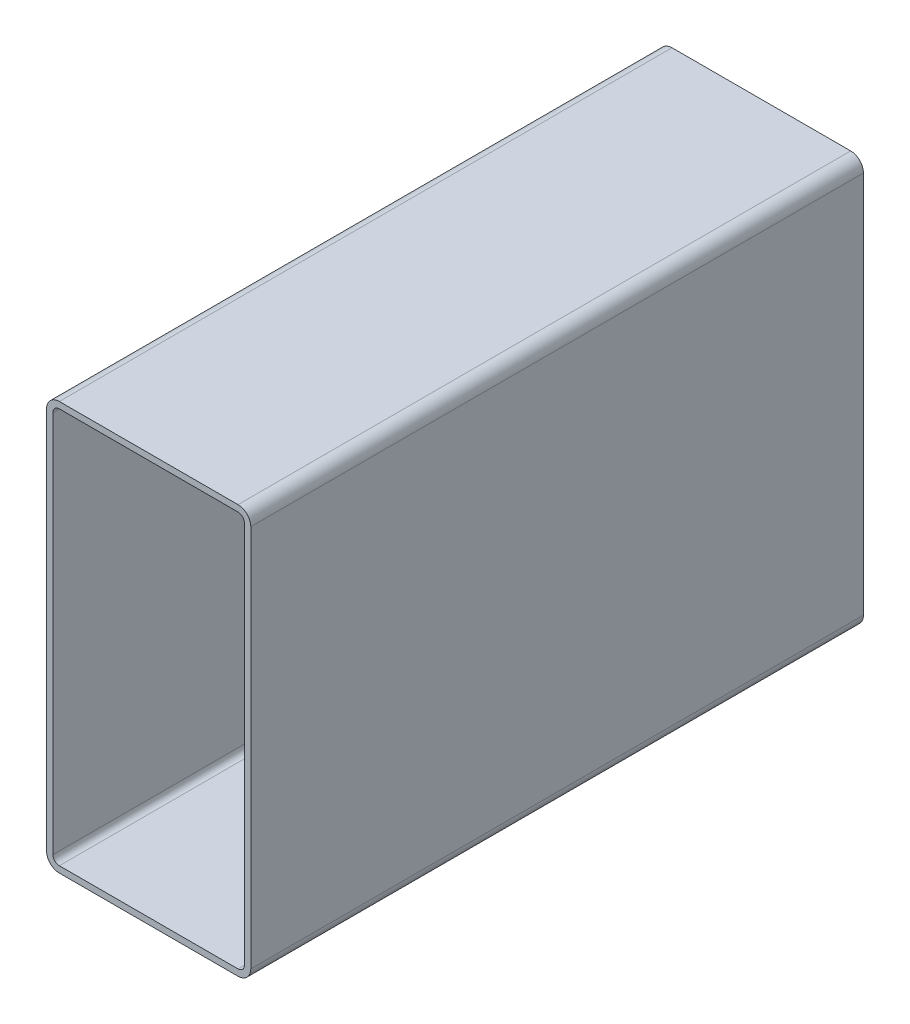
ISO-10303-21;
HEADER;
FILE_DESCRIPTION(('STEP AP214'),'2;1');
FILE_NAME('part.step','',(''),(''),'','','');
FILE_SCHEMA(('AUTOMOTIVE_DESIGN { 1 0 10303 214 1 1 1 1 }'));
ENDSEC;
DATA;
#1=APPLICATION_CONTEXT('core data for automotive mechanical design processes');
#2=APPLICATION_PROTOCOL_DEFINITION('international standard','automotive_design',2000,#1);
#3=PRODUCT_CONTEXT('',#1,'mechanical');
#4=PRODUCT('Part','Part','',(#3));
#5=PRODUCT_RELATED_PRODUCT_CATEGORY('part','',(#4));
#6=PRODUCT_DEFINITION_FORMATION('','',#4);
#7=PRODUCT_DEFINITION_CONTEXT('part definition',#1,'design');
#8=PRODUCT_DEFINITION('design','',#6,#7);
#9=PRODUCT_DEFINITION_SHAPE('','',#8);
#10=(LENGTH_UNIT() NAMED_UNIT(*) SI_UNIT(.MILLI.,.METRE.));
#11=(NAMED_UNIT(*) PLANE_ANGLE_UNIT() SI_UNIT($,.RADIAN.));
#12=(NAMED_UNIT(*) SI_UNIT($,.STERADIAN.) SOLID_ANGLE_UNIT());
#13=UNCERTAINTY_MEASURE_WITH_UNIT(LENGTH_MEASURE(1.E-05),#10,'distance_accuracy_value','');
#14=(GEOMETRIC_REPRESENTATION_CONTEXT(3) GLOBAL_UNCERTAINTY_ASSIGNED_CONTEXT((#13)) GLOBAL_UNIT_ASSIGNED_CONTEXT((#10,
#11,#12)) REPRESENTATION_CONTEXT('',''));
#15=CARTESIAN_POINT('',(0.,0.,0.));
#16=DIRECTION('',(0.,0.,1.));
#17=DIRECTION('',(1.,0.,0.));
#18=AXIS2_PLACEMENT_3D('',#15,#16,#17);
#19=CARTESIAN_POINT('',(8.02517782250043,198.816130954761,304.8));
#20=DIRECTION('',(0.,0.,1.));
#21=DIRECTION('',(1.,0.,0.));
#22=AXIS2_PLACEMENT_3D('',#19,#20,#21);
#23=PLANE('',#22);
#24=CARTESIAN_POINT('',(8.02517782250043,198.816130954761,304.8));
#25=DIRECTION('',(0.,0.,1.));
#26=DIRECTION('',(1.,0.,0.));
#27=AXIS2_PLACEMENT_3D('',#24,#25,#26);
#28=CIRCLE('',#27,6.35);
#29=CARTESIAN_POINT('',(8.02517782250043,205.166130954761,304.8));
#30=VERTEX_POINT('',#29);
#31=CARTESIAN_POINT('',(1.67517782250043,198.816130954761,304.8));
#32=VERTEX_POINT('',#31);
#33=EDGE_CURVE('E211',#30,#32,#28,.T.);
#34=ORIENTED_EDGE('',*,*,#33,.T.);
#35=DIRECTION('',(0.,-1.,0.));
#36=VECTOR('',#35,1.);
#37=CARTESIAN_POINT('',(1.67517782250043,8.31613095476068,304.8));
#38=LINE('',#37,#36);
#39=CARTESIAN_POINT('',(1.67517782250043,8.31613095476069,304.8));
#40=VERTEX_POINT('',#39);
#41=EDGE_CURVE('E214',#32,#40,#38,.T.);
#42=ORIENTED_EDGE('',*,*,#41,.T.);
#43=CARTESIAN_POINT('',(8.02517782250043,8.31613095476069,304.8));
#44=DIRECTION('',(0.,0.,1.));
#45=DIRECTION('',(1.,0.,0.));
#46=AXIS2_PLACEMENT_3D('',#43,#44,#45);
#47=CIRCLE('',#46,6.35);
#48=CARTESIAN_POINT('',(8.02517782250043,1.96613095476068,304.8));
#49=VERTEX_POINT('',#48);
#50=EDGE_CURVE('E217',#40,#49,#47,.T.);
#51=ORIENTED_EDGE('',*,*,#50,.T.);
#52=DIRECTION('',(1.,0.,0.));
#53=VECTOR('',#52,1.);
#54=CARTESIAN_POINT('',(96.9251778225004,1.96613095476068,304.8));
#55=LINE('',#54,#53);
#56=CARTESIAN_POINT('',(96.9251778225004,1.96613095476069,304.8));
#57=VERTEX_POINT('',#56);
#58=EDGE_CURVE('E219',#49,#57,#55,.T.);
#59=ORIENTED_EDGE('',*,*,#58,.T.);
#60=CARTESIAN_POINT('',(96.9251778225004,8.31613095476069,304.8));
#61=DIRECTION('',(0.,0.,1.));
#62=DIRECTION('',(1.,0.,0.));
#63=AXIS2_PLACEMENT_3D('',#60,#61,#62);
#64=CIRCLE('',#63,6.35);
#65=CARTESIAN_POINT('',(103.2751778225,8.31613095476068,304.8));
#66=VERTEX_POINT('',#65);
#67=EDGE_CURVE('E221',#57,#66,#64,.T.);
#68=ORIENTED_EDGE('',*,*,#67,.T.);
#69=DIRECTION('',(0.,1.,0.));
#70=VECTOR('',#69,1.);
#71=CARTESIAN_POINT('',(103.2751778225,198.816130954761,304.8));
#72=LINE('',#71,#70);
#73=CARTESIAN_POINT('',(103.2751778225,198.816130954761,304.8));
#74=VERTEX_POINT('',#73);
#75=EDGE_CURVE('E223',#66,#74,#72,.T.);
#76=ORIENTED_EDGE('',*,*,#75,.T.);
#77=CARTESIAN_POINT('',(96.9251778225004,198.816130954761,304.8));
#78=DIRECTION('',(0.,0.,1.));
#79=DIRECTION('',(1.,0.,0.));
#80=AXIS2_PLACEMENT_3D('',#77,#78,#79);
#81=CIRCLE('',#80,6.34999999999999);
#82=CARTESIAN_POINT('',(96.9251778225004,205.166130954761,304.8));
#83=VERTEX_POINT('',#82);
#84=EDGE_CURVE('E225',#74,#83,#81,.T.);
#85=ORIENTED_EDGE('',*,*,#84,.T.);
#86=DIRECTION('',(-1.,0.,0.));
#87=VECTOR('',#86,1.);
#88=CARTESIAN_POINT('',(8.02517782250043,205.166130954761,304.8));
#89=LINE('',#88,#87);
#90=EDGE_CURVE('E227',#83,#30,#89,.T.);
#91=ORIENTED_EDGE('',*,*,#90,.T.);
#92=EDGE_LOOP('',(#34,#42,#51,#59,#68,#76,#85,#91));
#93=FACE_BOUND('',#92,.T.);
#94=DIRECTION('',(0.,-1.,0.));
#95=VECTOR('',#94,1.);
#96=CARTESIAN_POINT('',(4.85017782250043,8.31613095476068,304.8));
#97=LINE('',#96,#95);
#98=CARTESIAN_POINT('',(4.85017782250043,198.816130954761,304.8));
#99=VERTEX_POINT('',#98);
#100=CARTESIAN_POINT('',(4.85017782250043,8.31613095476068,304.8));
#101=VERTEX_POINT('',#100);
#102=EDGE_CURVE('E154',#99,#101,#97,.T.);
#103=ORIENTED_EDGE('',*,*,#102,.F.);
#104=CARTESIAN_POINT('',(8.02517782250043,198.816130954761,304.8));
#105=DIRECTION('',(0.,0.,1.));
#106=DIRECTION('',(1.,0.,0.));
#107=AXIS2_PLACEMENT_3D('',#104,#105,#106);
#108=CIRCLE('',#107,3.17499999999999);
#109=CARTESIAN_POINT('',(8.02517782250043,201.991130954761,304.8));
#110=VERTEX_POINT('',#109);
#111=EDGE_CURVE('E146',#110,#99,#108,.T.);
#112=ORIENTED_EDGE('',*,*,#111,.F.);
#113=DIRECTION('',(-1.,0.,0.));
#114=VECTOR('',#113,1.);
#115=CARTESIAN_POINT('',(8.02517782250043,201.991130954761,304.8));
#116=LINE('',#115,#114);
#117=CARTESIAN_POINT('',(96.9251778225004,201.991130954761,304.8));
#118=VERTEX_POINT('',#117);
#119=EDGE_CURVE('E179',#118,#110,#116,.T.);
#120=ORIENTED_EDGE('',*,*,#119,.F.);
#121=CARTESIAN_POINT('',(96.9251778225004,198.816130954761,304.8));
#122=DIRECTION('',(0.,0.,1.));
#123=DIRECTION('',(1.,0.,0.));
#124=AXIS2_PLACEMENT_3D('',#121,#122,#123);
#125=CIRCLE('',#124,3.17499999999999);
#126=CARTESIAN_POINT('',(100.1001778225,198.816130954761,304.8));
#127=VERTEX_POINT('',#126);
#128=EDGE_CURVE('E177',#127,#118,#125,.T.);
#129=ORIENTED_EDGE('',*,*,#128,.F.);
#130=DIRECTION('',(0.,1.,0.));
#131=VECTOR('',#130,1.);
#132=CARTESIAN_POINT('',(100.1001778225,198.816130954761,304.8));
#133=LINE('',#132,#131);
#134=CARTESIAN_POINT('',(100.1001778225,8.31613095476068,304.8));
#135=VERTEX_POINT('',#134);
#136=EDGE_CURVE('E175',#135,#127,#133,.T.);
#137=ORIENTED_EDGE('',*,*,#136,.F.);
#138=CARTESIAN_POINT('',(96.9251778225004,8.31613095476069,304.8));
#139=DIRECTION('',(0.,0.,1.));
#140=DIRECTION('',(1.,0.,0.));
#141=AXIS2_PLACEMENT_3D('',#138,#139,#140);
#142=CIRCLE('',#141,3.175);
#143=CARTESIAN_POINT('',(96.9251778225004,5.14113095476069,304.8));
#144=VERTEX_POINT('',#143);
#145=EDGE_CURVE('E173',#144,#135,#142,.T.);
#146=ORIENTED_EDGE('',*,*,#145,.F.);
#147=DIRECTION('',(1.,0.,0.));
#148=VECTOR('',#147,1.);
#149=CARTESIAN_POINT('',(96.9251778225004,5.14113095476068,304.8));
#150=LINE('',#149,#148);
#151=CARTESIAN_POINT('',(8.02517782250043,5.14113095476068,304.8));
#152=VERTEX_POINT('',#151);
#153=EDGE_CURVE('E169',#152,#144,#150,.T.);
#154=ORIENTED_EDGE('',*,*,#153,.F.);
#155=CARTESIAN_POINT('',(8.02517782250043,8.31613095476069,304.8));
#156=DIRECTION('',(0.,0.,1.));
#157=DIRECTION('',(1.,0.,0.));
#158=AXIS2_PLACEMENT_3D('',#155,#156,#157);
#159=CIRCLE('',#158,3.175);
#160=EDGE_CURVE('E167',#101,#152,#159,.T.);
#161=ORIENTED_EDGE('',*,*,#160,.F.);
#162=EDGE_LOOP('',(#103,#112,#120,#129,#137,#146,#154,#161));
#163=FACE_BOUND('',#162,.T.);
#164=ADVANCED_FACE('F33',(#93,#163),#23,.T.);
#165=CARTESIAN_POINT('',(8.02517782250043,198.816130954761,0.));
#166=DIRECTION('',(0.,0.,1.));
#167=DIRECTION('',(1.,0.,0.));
#168=AXIS2_PLACEMENT_3D('',#165,#166,#167);
#169=PLANE('',#168);
#170=CARTESIAN_POINT('',(8.02517782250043,198.816130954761,0.));
#171=DIRECTION('',(0.,0.,1.));
#172=DIRECTION('',(1.,0.,0.));
#173=AXIS2_PLACEMENT_3D('',#170,#171,#172);
#174=CIRCLE('',#173,6.35);
#175=CARTESIAN_POINT('',(8.02517782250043,205.166130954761,0.));
#176=VERTEX_POINT('',#175);
#177=CARTESIAN_POINT('',(1.67517782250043,198.816130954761,0.));
#178=VERTEX_POINT('',#177);
#179=EDGE_CURVE('E162',#176,#178,#174,.T.);
#180=ORIENTED_EDGE('',*,*,#179,.F.);
#181=DIRECTION('',(-1.,0.,0.));
#182=VECTOR('',#181,1.);
#183=CARTESIAN_POINT('',(8.02517782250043,205.166130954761,0.));
#184=LINE('',#183,#182);
#185=CARTESIAN_POINT('',(96.9251778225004,205.166130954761,0.));
#186=VERTEX_POINT('',#185);
#187=EDGE_CURVE('E215',#186,#176,#184,.T.);
#188=ORIENTED_EDGE('',*,*,#187,.F.);
#189=CARTESIAN_POINT('',(96.9251778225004,198.816130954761,0.));
#190=DIRECTION('',(0.,0.,1.));
#191=DIRECTION('',(1.,0.,0.));
#192=AXIS2_PLACEMENT_3D('',#189,#190,#191);
#193=CIRCLE('',#192,6.34999999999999);
#194=CARTESIAN_POINT('',(103.2751778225,198.816130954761,0.));
#195=VERTEX_POINT('',#194);
#196=EDGE_CURVE('E242',#195,#186,#193,.T.);
#197=ORIENTED_EDGE('',*,*,#196,.F.);
#198=DIRECTION('',(0.,1.,0.));
#199=VECTOR('',#198,1.);
#200=CARTESIAN_POINT('',(103.2751778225,198.816130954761,0.));
#201=LINE('',#200,#199);
#202=CARTESIAN_POINT('',(103.2751778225,8.31613095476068,0.));
#203=VERTEX_POINT('',#202);
#204=EDGE_CURVE('E240',#203,#195,#201,.T.);
#205=ORIENTED_EDGE('',*,*,#204,.F.);
#206=CARTESIAN_POINT('',(96.9251778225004,8.31613095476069,0.));
#207=DIRECTION('',(0.,0.,1.));
#208=DIRECTION('',(1.,0.,0.));
#209=AXIS2_PLACEMENT_3D('',#206,#207,#208);
#210=CIRCLE('',#209,6.35);
#211=CARTESIAN_POINT('',(96.9251778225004,1.96613095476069,0.));
#212=VERTEX_POINT('',#211);
#213=EDGE_CURVE('E238',#212,#203,#210,.T.);
#214=ORIENTED_EDGE('',*,*,#213,.F.);
#215=DIRECTION('',(1.,0.,0.));
#216=VECTOR('',#215,1.);
#217=CARTESIAN_POINT('',(96.9251778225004,1.96613095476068,0.));
#218=LINE('',#217,#216);
#219=CARTESIAN_POINT('',(8.02517782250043,1.96613095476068,0.));
#220=VERTEX_POINT('',#219);
#221=EDGE_CURVE('E236',#220,#212,#218,.T.);
#222=ORIENTED_EDGE('',*,*,#221,.F.);
#223=CARTESIAN_POINT('',(8.02517782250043,8.31613095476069,0.));
#224=DIRECTION('',(0.,0.,1.));
#225=DIRECTION('',(1.,0.,0.));
#226=AXIS2_PLACEMENT_3D('',#223,#224,#225);
#227=CIRCLE('',#226,6.35);
#228=CARTESIAN_POINT('',(1.67517782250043,8.31613095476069,0.));
#229=VERTEX_POINT('',#228);
#230=EDGE_CURVE('E234',#229,#220,#227,.T.);
#231=ORIENTED_EDGE('',*,*,#230,.F.);
#232=DIRECTION('',(0.,-1.,0.));
#233=VECTOR('',#232,1.);
#234=CARTESIAN_POINT('',(1.67517782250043,8.31613095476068,0.));
#235=LINE('',#234,#233);
#236=EDGE_CURVE('E232',#178,#229,#235,.T.);
#237=ORIENTED_EDGE('',*,*,#236,.F.);
#238=EDGE_LOOP('',(#180,#188,#197,#205,#214,#222,#231,#237));
#239=FACE_BOUND('',#238,.T.);
#240=CARTESIAN_POINT('',(8.02517782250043,198.816130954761,0.));
#241=DIRECTION('',(0.,0.,1.));
#242=DIRECTION('',(1.,0.,0.));
#243=AXIS2_PLACEMENT_3D('',#240,#241,#242);
#244=CIRCLE('',#243,3.17499999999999);
#245=CARTESIAN_POINT('',(8.02517782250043,201.991130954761,0.));
#246=VERTEX_POINT('',#245);
#247=CARTESIAN_POINT('',(4.85017782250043,198.816130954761,0.));
#248=VERTEX_POINT('',#247);
#249=EDGE_CURVE('E56',#246,#248,#244,.T.);
#250=ORIENTED_EDGE('',*,*,#249,.T.);
#251=DIRECTION('',(0.,-1.,0.));
#252=VECTOR('',#251,1.);
#253=CARTESIAN_POINT('',(4.85017782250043,8.31613095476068,0.));
#254=LINE('',#253,#252);
#255=CARTESIAN_POINT('',(4.85017782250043,8.31613095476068,0.));
#256=VERTEX_POINT('',#255);
#257=EDGE_CURVE('E161',#248,#256,#254,.T.);
#258=ORIENTED_EDGE('',*,*,#257,.T.);
#259=CARTESIAN_POINT('',(8.02517782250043,8.31613095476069,0.));
#260=DIRECTION('',(0.,0.,1.));
#261=DIRECTION('',(1.,0.,0.));
#262=AXIS2_PLACEMENT_3D('',#259,#260,#261);
#263=CIRCLE('',#262,3.175);
#264=CARTESIAN_POINT('',(8.02517782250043,5.14113095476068,0.));
#265=VERTEX_POINT('',#264);
#266=EDGE_CURVE('E183',#256,#265,#263,.T.);
#267=ORIENTED_EDGE('',*,*,#266,.T.);
#268=DIRECTION('',(1.,0.,0.));
#269=VECTOR('',#268,1.);
#270=CARTESIAN_POINT('',(96.9251778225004,5.14113095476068,0.));
#271=LINE('',#270,#269);
#272=CARTESIAN_POINT('',(96.9251778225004,5.14113095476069,0.));
#273=VERTEX_POINT('',#272);
#274=EDGE_CURVE('E186',#265,#273,#271,.T.);
#275=ORIENTED_EDGE('',*,*,#274,.T.);
#276=CARTESIAN_POINT('',(96.9251778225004,8.31613095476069,0.));
#277=DIRECTION('',(0.,0.,1.));
#278=DIRECTION('',(1.,0.,0.));
#279=AXIS2_PLACEMENT_3D('',#276,#277,#278);
#280=CIRCLE('',#279,3.175);
#281=CARTESIAN_POINT('',(100.1001778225,8.31613095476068,0.));
#282=VERTEX_POINT('',#281);
#283=EDGE_CURVE('E189',#273,#282,#280,.T.);
#284=ORIENTED_EDGE('',*,*,#283,.T.);
#285=DIRECTION('',(0.,1.,0.));
#286=VECTOR('',#285,1.);
#287=CARTESIAN_POINT('',(100.1001778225,198.816130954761,0.));
#288=LINE('',#287,#286);
#289=CARTESIAN_POINT('',(100.1001778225,198.816130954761,0.));
#290=VERTEX_POINT('',#289);
#291=EDGE_CURVE('E192',#282,#290,#288,.T.);
#292=ORIENTED_EDGE('',*,*,#291,.T.);
#293=CARTESIAN_POINT('',(96.9251778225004,198.816130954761,0.));
#294=DIRECTION('',(0.,0.,1.));
#295=DIRECTION('',(1.,0.,0.));
#296=AXIS2_PLACEMENT_3D('',#293,#294,#295);
#297=CIRCLE('',#296,3.17499999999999);
#298=CARTESIAN_POINT('',(96.9251778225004,201.991130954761,0.));
#299=VERTEX_POINT('',#298);
#300=EDGE_CURVE('E195',#290,#299,#297,.T.);
#301=ORIENTED_EDGE('',*,*,#300,.T.);
#302=DIRECTION('',(-1.,0.,0.));
#303=VECTOR('',#302,1.);
#304=CARTESIAN_POINT('',(8.02517782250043,201.991130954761,0.));
#305=LINE('',#304,#303);
#306=EDGE_CURVE('E155',#299,#246,#305,.T.);
#307=ORIENTED_EDGE('',*,*,#306,.T.);
#308=EDGE_LOOP('',(#250,#258,#267,#275,#284,#292,#301,#307));
#309=FACE_BOUND('',#308,.T.);
#310=ADVANCED_FACE('F272',(#239,#309),#169,.F.);
#311=CARTESIAN_POINT('',(8.02517782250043,198.816130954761,304.8));
#312=DIRECTION('',(0.,0.,-1.));
#313=DIRECTION('',(-1.,0.,0.));
#314=AXIS2_PLACEMENT_3D('',#311,#312,#313);
#315=CYLINDRICAL_SURFACE('',#314,6.35);
#316=ORIENTED_EDGE('',*,*,#179,.T.);
#317=DIRECTION('',(0.,0.,-1.));
#318=VECTOR('',#317,1.);
#319=CARTESIAN_POINT('',(1.67517782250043,198.816130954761,304.8));
#320=LINE('',#319,#318);
#321=EDGE_CURVE('E11',#32,#178,#320,.T.);
#322=ORIENTED_EDGE('',*,*,#321,.F.);
#323=ORIENTED_EDGE('',*,*,#33,.F.);
#324=DIRECTION('',(0.,0.,-1.));
#325=VECTOR('',#324,1.);
#326=CARTESIAN_POINT('',(8.02517782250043,205.166130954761,304.8));
#327=LINE('',#326,#325);
#328=EDGE_CURVE('E229',#30,#176,#327,.T.);
#329=ORIENTED_EDGE('',*,*,#328,.T.);
#330=EDGE_LOOP('',(#316,#322,#323,#329));
#331=FACE_BOUND('',#330,.T.);
#332=ADVANCED_FACE('F35',(#331),#315,.T.);
#333=CARTESIAN_POINT('',(1.67517782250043,8.31613095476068,304.8));
#334=DIRECTION('',(1.,0.,0.));
#335=DIRECTION('',(0.,0.,-1.));
#336=AXIS2_PLACEMENT_3D('',#333,#334,#335);
#337=PLANE('',#336);
#338=ORIENTED_EDGE('',*,*,#236,.T.);
#339=DIRECTION('',(0.,0.,-1.));
#340=VECTOR('',#339,1.);
#341=CARTESIAN_POINT('',(1.67517782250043,8.31613095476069,304.8));
#342=LINE('',#341,#340);
#343=EDGE_CURVE('E41',#40,#229,#342,.T.);
#344=ORIENTED_EDGE('',*,*,#343,.F.);
#345=ORIENTED_EDGE('',*,*,#41,.F.);
#346=ORIENTED_EDGE('',*,*,#321,.T.);
#347=EDGE_LOOP('',(#338,#344,#345,#346));
#348=FACE_BOUND('',#347,.T.);
#349=ADVANCED_FACE('F289',(#348),#337,.F.);
#350=CARTESIAN_POINT('',(8.02517782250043,8.31613095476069,304.8));
#351=DIRECTION('',(0.,0.,-1.));
#352=DIRECTION('',(-1.,0.,0.));
#353=AXIS2_PLACEMENT_3D('',#350,#351,#352);
#354=CYLINDRICAL_SURFACE('',#353,6.35);
#355=ORIENTED_EDGE('',*,*,#230,.T.);
#356=DIRECTION('',(0.,0.,-1.));
#357=VECTOR('',#356,1.);
#358=CARTESIAN_POINT('',(8.02517782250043,1.96613095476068,304.8));
#359=LINE('',#358,#357);
#360=EDGE_CURVE('E259',#49,#220,#359,.T.);
#361=ORIENTED_EDGE('',*,*,#360,.F.);
#362=ORIENTED_EDGE('',*,*,#50,.F.);
#363=ORIENTED_EDGE('',*,*,#343,.T.);
#364=EDGE_LOOP('',(#355,#361,#362,#363));
#365=FACE_BOUND('',#364,.T.);
#366=ADVANCED_FACE('F266',(#365),#354,.T.);
#367=CARTESIAN_POINT('',(96.9251778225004,1.96613095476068,304.8));
#368=DIRECTION('',(0.,1.,0.));
#369=DIRECTION('',(0.,0.,1.));
#370=AXIS2_PLACEMENT_3D('',#367,#368,#369);
#371=PLANE('',#370);
#372=ORIENTED_EDGE('',*,*,#221,.T.);
#373=DIRECTION('',(0.,0.,-1.));
#374=VECTOR('',#373,1.);
#375=CARTESIAN_POINT('',(96.9251778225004,1.96613095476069,304.8));
#376=LINE('',#375,#374);
#377=EDGE_CURVE('E256',#57,#212,#376,.T.);
#378=ORIENTED_EDGE('',*,*,#377,.F.);
#379=ORIENTED_EDGE('',*,*,#58,.F.);
#380=ORIENTED_EDGE('',*,*,#360,.T.);
#381=EDGE_LOOP('',(#372,#378,#379,#380));
#382=FACE_BOUND('',#381,.T.);
#383=ADVANCED_FACE('F278',(#382),#371,.F.);
#384=CARTESIAN_POINT('',(96.9251778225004,8.31613095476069,304.8));
#385=DIRECTION('',(0.,0.,-1.));
#386=DIRECTION('',(-1.,0.,0.));
#387=AXIS2_PLACEMENT_3D('',#384,#385,#386);
#388=CYLINDRICAL_SURFACE('',#387,6.35);
#389=ORIENTED_EDGE('',*,*,#213,.T.);
#390=DIRECTION('',(0.,0.,-1.));
#391=VECTOR('',#390,1.);
#392=CARTESIAN_POINT('',(103.2751778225,8.31613095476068,304.8));
#393=LINE('',#392,#391);
#394=EDGE_CURVE('E253',#66,#203,#393,.T.);
#395=ORIENTED_EDGE('',*,*,#394,.F.);
#396=ORIENTED_EDGE('',*,*,#67,.F.);
#397=ORIENTED_EDGE('',*,*,#377,.T.);
#398=EDGE_LOOP('',(#389,#395,#396,#397));
#399=FACE_BOUND('',#398,.T.);
#400=ADVANCED_FACE('F282',(#399),#388,.T.);
#401=CARTESIAN_POINT('',(103.2751778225,198.816130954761,304.8));
#402=DIRECTION('',(-1.,0.,0.));
#403=DIRECTION('',(0.,0.,1.));
#404=AXIS2_PLACEMENT_3D('',#401,#402,#403);
#405=PLANE('',#404);
#406=ORIENTED_EDGE('',*,*,#204,.T.);
#407=DIRECTION('',(0.,0.,-1.));
#408=VECTOR('',#407,1.);
#409=CARTESIAN_POINT('',(103.2751778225,198.816130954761,304.8));
#410=LINE('',#409,#408);
#411=EDGE_CURVE('E250',#74,#195,#410,.T.);
#412=ORIENTED_EDGE('',*,*,#411,.F.);
#413=ORIENTED_EDGE('',*,*,#75,.F.);
#414=ORIENTED_EDGE('',*,*,#394,.T.);
#415=EDGE_LOOP('',(#406,#412,#413,#414));
#416=FACE_BOUND('',#415,.T.);
#417=ADVANCED_FACE('F302',(#416),#405,.F.);
#418=CARTESIAN_POINT('',(96.9251778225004,198.816130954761,304.8));
#419=DIRECTION('',(0.,0.,-1.));
#420=DIRECTION('',(-1.,0.,0.));
#421=AXIS2_PLACEMENT_3D('',#418,#419,#420);
#422=CYLINDRICAL_SURFACE('',#421,6.34999999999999);
#423=ORIENTED_EDGE('',*,*,#196,.T.);
#424=DIRECTION('',(0.,0.,-1.));
#425=VECTOR('',#424,1.);
#426=CARTESIAN_POINT('',(96.9251778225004,205.166130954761,304.8));
#427=LINE('',#426,#425);
#428=EDGE_CURVE('E247',#83,#186,#427,.T.);
#429=ORIENTED_EDGE('',*,*,#428,.F.);
#430=ORIENTED_EDGE('',*,*,#84,.F.);
#431=ORIENTED_EDGE('',*,*,#411,.T.);
#432=EDGE_LOOP('',(#423,#429,#430,#431));
#433=FACE_BOUND('',#432,.T.);
#434=ADVANCED_FACE('F300',(#433),#422,.T.);
#435=CARTESIAN_POINT('',(8.02517782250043,205.166130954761,304.8));
#436=DIRECTION('',(0.,-1.,0.));
#437=DIRECTION('',(0.,0.,-1.));
#438=AXIS2_PLACEMENT_3D('',#435,#436,#437);
#439=PLANE('',#438);
#440=ORIENTED_EDGE('',*,*,#187,.T.);
#441=ORIENTED_EDGE('',*,*,#328,.F.);
#442=ORIENTED_EDGE('',*,*,#90,.F.);
#443=ORIENTED_EDGE('',*,*,#428,.T.);
#444=EDGE_LOOP('',(#440,#441,#442,#443));
#445=FACE_BOUND('',#444,.T.);
#446=ADVANCED_FACE('F295',(#445),#439,.F.);
#447=CARTESIAN_POINT('',(8.02517782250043,198.816130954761,304.8));
#448=DIRECTION('',(0.,0.,-1.));
#449=DIRECTION('',(-1.,0.,0.));
#450=AXIS2_PLACEMENT_3D('',#447,#448,#449);
#451=CYLINDRICAL_SURFACE('',#450,3.17499999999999);
#452=ORIENTED_EDGE('',*,*,#249,.F.);
#453=DIRECTION('',(0.,0.,-1.));
#454=VECTOR('',#453,1.);
#455=CARTESIAN_POINT('',(8.02517782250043,201.991130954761,304.8));
#456=LINE('',#455,#454);
#457=EDGE_CURVE('E150',#110,#246,#456,.T.);
#458=ORIENTED_EDGE('',*,*,#457,.F.);
#459=ORIENTED_EDGE('',*,*,#111,.T.);
#460=DIRECTION('',(0.,0.,-1.));
#461=VECTOR('',#460,1.);
#462=CARTESIAN_POINT('',(4.85017782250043,198.816130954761,304.8));
#463=LINE('',#462,#461);
#464=EDGE_CURVE('E149',#99,#248,#463,.T.);
#465=ORIENTED_EDGE('',*,*,#464,.T.);
#466=EDGE_LOOP('',(#452,#458,#459,#465));
#467=FACE_BOUND('',#466,.T.);
#468=ADVANCED_FACE('F148',(#467),#451,.F.);
#469=CARTESIAN_POINT('',(4.85017782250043,8.31613095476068,304.8));
#470=DIRECTION('',(1.,0.,0.));
#471=DIRECTION('',(0.,0.,-1.));
#472=AXIS2_PLACEMENT_3D('',#469,#470,#471);
#473=PLANE('',#472);
#474=ORIENTED_EDGE('',*,*,#257,.F.);
#475=ORIENTED_EDGE('',*,*,#464,.F.);
#476=ORIENTED_EDGE('',*,*,#102,.T.);
#477=DIRECTION('',(0.,0.,-1.));
#478=VECTOR('',#477,1.);
#479=CARTESIAN_POINT('',(4.85017782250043,8.31613095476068,304.8));
#480=LINE('',#479,#478);
#481=EDGE_CURVE('E163',#101,#256,#480,.T.);
#482=ORIENTED_EDGE('',*,*,#481,.T.);
#483=EDGE_LOOP('',(#474,#475,#476,#482));
#484=FACE_BOUND('',#483,.T.);
#485=ADVANCED_FACE('F158',(#484),#473,.T.);
#486=CARTESIAN_POINT('',(8.02517782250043,8.31613095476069,304.8));
#487=DIRECTION('',(0.,0.,-1.));
#488=DIRECTION('',(-1.,0.,0.));
#489=AXIS2_PLACEMENT_3D('',#486,#487,#488);
#490=CYLINDRICAL_SURFACE('',#489,3.175);
#491=ORIENTED_EDGE('',*,*,#266,.F.);
#492=ORIENTED_EDGE('',*,*,#481,.F.);
#493=ORIENTED_EDGE('',*,*,#160,.T.);
#494=DIRECTION('',(0.,0.,-1.));
#495=VECTOR('',#494,1.);
#496=CARTESIAN_POINT('',(8.02517782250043,5.14113095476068,304.8));
#497=LINE('',#496,#495);
#498=EDGE_CURVE('E208',#152,#265,#497,.T.);
#499=ORIENTED_EDGE('',*,*,#498,.T.);
#500=EDGE_LOOP('',(#491,#492,#493,#499));
#501=FACE_BOUND('',#500,.T.);
#502=ADVANCED_FACE('F327',(#501),#490,.F.);
#503=CARTESIAN_POINT('',(96.9251778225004,5.14113095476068,304.8));
#504=DIRECTION('',(0.,1.,0.));
#505=DIRECTION('',(0.,0.,1.));
#506=AXIS2_PLACEMENT_3D('',#503,#504,#505);
#507=PLANE('',#506);
#508=ORIENTED_EDGE('',*,*,#274,.F.);
#509=ORIENTED_EDGE('',*,*,#498,.F.);
#510=ORIENTED_EDGE('',*,*,#153,.T.);
#511=DIRECTION('',(0.,0.,-1.));
#512=VECTOR('',#511,1.);
#513=CARTESIAN_POINT('',(96.9251778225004,5.14113095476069,304.8));
#514=LINE('',#513,#512);
#515=EDGE_CURVE('E206',#144,#273,#514,.T.);
#516=ORIENTED_EDGE('',*,*,#515,.T.);
#517=EDGE_LOOP('',(#508,#509,#510,#516));
#518=FACE_BOUND('',#517,.T.);
#519=ADVANCED_FACE('F331',(#518),#507,.T.);
#520=CARTESIAN_POINT('',(96.9251778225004,8.31613095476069,304.8));
#521=DIRECTION('',(0.,0.,-1.));
#522=DIRECTION('',(-1.,0.,0.));
#523=AXIS2_PLACEMENT_3D('',#520,#521,#522);
#524=CYLINDRICAL_SURFACE('',#523,3.175);
#525=ORIENTED_EDGE('',*,*,#283,.F.);
#526=ORIENTED_EDGE('',*,*,#515,.F.);
#527=ORIENTED_EDGE('',*,*,#145,.T.);
#528=DIRECTION('',(0.,0.,-1.));
#529=VECTOR('',#528,1.);
#530=CARTESIAN_POINT('',(100.1001778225,8.31613095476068,304.8));
#531=LINE('',#530,#529);
#532=EDGE_CURVE('E204',#135,#282,#531,.T.);
#533=ORIENTED_EDGE('',*,*,#532,.T.);
#534=EDGE_LOOP('',(#525,#526,#527,#533));
#535=FACE_BOUND('',#534,.T.);
#536=ADVANCED_FACE('F337',(#535),#524,.F.);
#537=CARTESIAN_POINT('',(100.1001778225,198.816130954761,304.8));
#538=DIRECTION('',(-1.,0.,0.));
#539=DIRECTION('',(0.,0.,1.));
#540=AXIS2_PLACEMENT_3D('',#537,#538,#539);
#541=PLANE('',#540);
#542=ORIENTED_EDGE('',*,*,#291,.F.);
#543=ORIENTED_EDGE('',*,*,#532,.F.);
#544=ORIENTED_EDGE('',*,*,#136,.T.);
#545=DIRECTION('',(0.,0.,-1.));
#546=VECTOR('',#545,1.);
#547=CARTESIAN_POINT('',(100.1001778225,198.816130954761,304.8));
#548=LINE('',#547,#546);
#549=EDGE_CURVE('E202',#127,#290,#548,.T.);
#550=ORIENTED_EDGE('',*,*,#549,.T.);
#551=EDGE_LOOP('',(#542,#543,#544,#550));
#552=FACE_BOUND('',#551,.T.);
#553=ADVANCED_FACE('F341',(#552),#541,.T.);
#554=CARTESIAN_POINT('',(96.9251778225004,198.816130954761,304.8));
#555=DIRECTION('',(0.,0.,-1.));
#556=DIRECTION('',(-1.,0.,0.));
#557=AXIS2_PLACEMENT_3D('',#554,#555,#556);
#558=CYLINDRICAL_SURFACE('',#557,3.17499999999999);
#559=ORIENTED_EDGE('',*,*,#300,.F.);
#560=ORIENTED_EDGE('',*,*,#549,.F.);
#561=ORIENTED_EDGE('',*,*,#128,.T.);
#562=DIRECTION('',(0.,0.,-1.));
#563=VECTOR('',#562,1.);
#564=CARTESIAN_POINT('',(96.9251778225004,201.991130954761,304.8));
#565=LINE('',#564,#563);
#566=EDGE_CURVE('E48',#118,#299,#565,.T.);
#567=ORIENTED_EDGE('',*,*,#566,.T.);
#568=EDGE_LOOP('',(#559,#560,#561,#567));
#569=FACE_BOUND('',#568,.T.);
#570=ADVANCED_FACE('F345',(#569),#558,.F.);
#571=CARTESIAN_POINT('',(8.02517782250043,201.991130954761,304.8));
#572=DIRECTION('',(0.,-1.,0.));
#573=DIRECTION('',(0.,0.,-1.));
#574=AXIS2_PLACEMENT_3D('',#571,#572,#573);
#575=PLANE('',#574);
#576=ORIENTED_EDGE('',*,*,#306,.F.);
#577=ORIENTED_EDGE('',*,*,#566,.F.);
#578=ORIENTED_EDGE('',*,*,#119,.T.);
#579=ORIENTED_EDGE('',*,*,#457,.T.);
#580=EDGE_LOOP('',(#576,#577,#578,#579));
#581=FACE_BOUND('',#580,.T.);
#582=ADVANCED_FACE('F349',(#581),#575,.T.);
#583=CLOSED_SHELL('',(#164,#310,#332,#349,#366,#383,#400,#417,#434,#446,#468,#485,#502,#519,
#536,#553,#570,#582));
#584=MANIFOLD_SOLID_BREP('B2',#583);
#585=ADVANCED_BREP_SHAPE_REPRESENTATION('',(#18,#584),#14);
#586=SHAPE_DEFINITION_REPRESENTATION(#9,#585);
ENDSEC;
END-ISO-10303-21;
